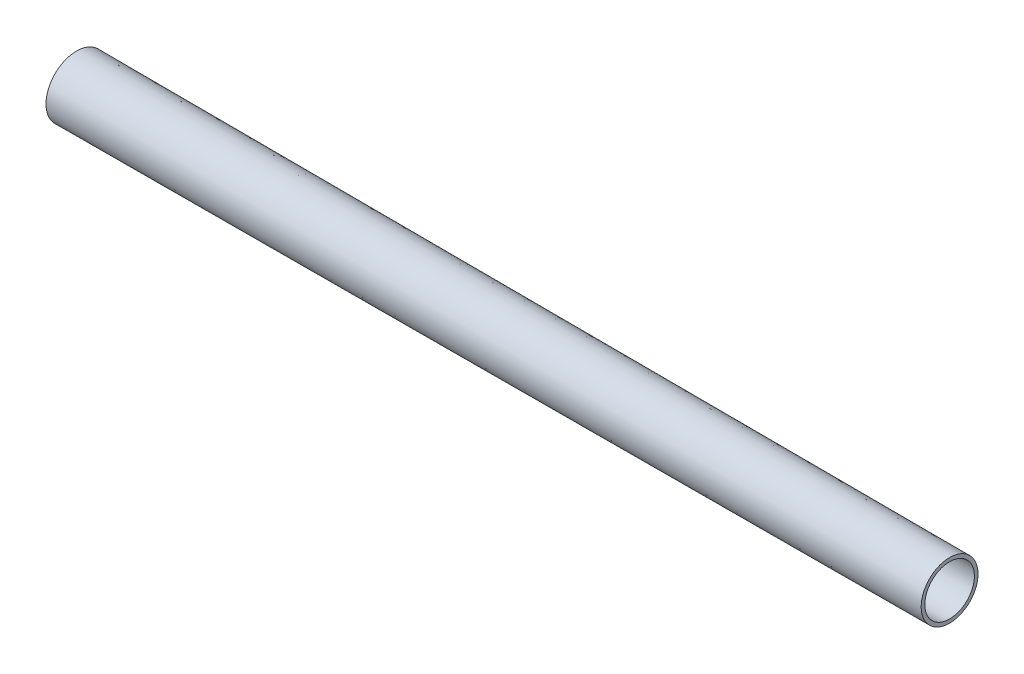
ISO-10303-21;
HEADER;
FILE_DESCRIPTION(('STEP AP214'),'2;1');
FILE_NAME('part.step','',(''),(''),'','','');
FILE_SCHEMA(('AUTOMOTIVE_DESIGN { 1 0 10303 214 1 1 1 1 }'));
ENDSEC;
DATA;
#1=APPLICATION_CONTEXT('core data for automotive mechanical design processes');
#2=APPLICATION_PROTOCOL_DEFINITION('international standard','automotive_design',2000,#1);
#3=PRODUCT_CONTEXT('',#1,'mechanical');
#4=PRODUCT('Part','Part','',(#3));
#5=PRODUCT_RELATED_PRODUCT_CATEGORY('part','',(#4));
#6=PRODUCT_DEFINITION_FORMATION('','',#4);
#7=PRODUCT_DEFINITION_CONTEXT('part definition',#1,'design');
#8=PRODUCT_DEFINITION('design','',#6,#7);
#9=PRODUCT_DEFINITION_SHAPE('','',#8);
#10=(LENGTH_UNIT() NAMED_UNIT(*) SI_UNIT(.MILLI.,.METRE.));
#11=(NAMED_UNIT(*) PLANE_ANGLE_UNIT() SI_UNIT($,.RADIAN.));
#12=(NAMED_UNIT(*) SI_UNIT($,.STERADIAN.) SOLID_ANGLE_UNIT());
#13=UNCERTAINTY_MEASURE_WITH_UNIT(LENGTH_MEASURE(1.E-05),#10,'distance_accuracy_value','');
#14=(GEOMETRIC_REPRESENTATION_CONTEXT(3) GLOBAL_UNCERTAINTY_ASSIGNED_CONTEXT((#13)) GLOBAL_UNIT_ASSIGNED_CONTEXT((#10,
#11,#12)) REPRESENTATION_CONTEXT('',''));
#15=CARTESIAN_POINT('',(0.,0.,0.));
#16=DIRECTION('',(0.,0.,1.));
#17=DIRECTION('',(1.,0.,0.));
#18=AXIS2_PLACEMENT_3D('',#15,#16,#17);
#19=CARTESIAN_POINT('',(34.29,0.,0.));
#20=DIRECTION('',(-1.,0.,0.));
#21=DIRECTION('',(0.,0.,1.));
#22=AXIS2_PLACEMENT_3D('',#19,#20,#21);
#23=CONICAL_SURFACE('',#22,7.43085106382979,0.00238894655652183);
#24=CARTESIAN_POINT('',(275.59,0.,0.));
#25=DIRECTION('',(-1.,0.,0.));
#26=DIRECTION('',(0.,0.,1.));
#27=AXIS2_PLACEMENT_3D('',#24,#25,#26);
#28=CIRCLE('',#27,6.85439716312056);
#29=CARTESIAN_POINT('',(275.59,0.,6.85439716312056));
#30=VERTEX_POINT('',#29);
#31=EDGE_CURVE('E10',#30,#30,#28,.T.);
#32=ORIENTED_EDGE('',*,*,#31,.F.);
#33=EDGE_LOOP('',(#32));
#34=FACE_BOUND('',#33,.T.);
#35=CARTESIAN_POINT('',(34.29,0.,0.));
#36=DIRECTION('',(-1.,0.,0.));
#37=DIRECTION('',(0.,0.,1.));
#38=AXIS2_PLACEMENT_3D('',#35,#36,#37);
#39=CIRCLE('',#38,7.43085106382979);
#40=CARTESIAN_POINT('',(34.29,0.,7.43085106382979));
#41=VERTEX_POINT('',#40);
#42=EDGE_CURVE('E47',#41,#41,#39,.T.);
#43=ORIENTED_EDGE('',*,*,#42,.T.);
#44=EDGE_LOOP('',(#43));
#45=FACE_BOUND('',#44,.T.);
#46=ADVANCED_FACE('F33',(#34,#45),#23,.F.);
#47=CARTESIAN_POINT('',(275.59,6.85439716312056,0.));
#48=DIRECTION('',(-1.,0.,0.));
#49=DIRECTION('',(0.,0.,1.));
#50=AXIS2_PLACEMENT_3D('',#47,#48,#49);
#51=PLANE('',#50);
#52=CARTESIAN_POINT('',(275.59,0.,0.));
#53=DIRECTION('',(-1.,0.,0.));
#54=DIRECTION('',(0.,0.,1.));
#55=AXIS2_PLACEMENT_3D('',#52,#53,#54);
#56=CIRCLE('',#55,7.8631914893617);
#57=CARTESIAN_POINT('',(275.59,0.,7.8631914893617));
#58=VERTEX_POINT('',#57);
#59=EDGE_CURVE('E39',#58,#58,#56,.T.);
#60=ORIENTED_EDGE('',*,*,#59,.F.);
#61=EDGE_LOOP('',(#60));
#62=FACE_BOUND('',#61,.T.);
#63=ORIENTED_EDGE('',*,*,#31,.T.);
#64=EDGE_LOOP('',(#63));
#65=FACE_BOUND('',#64,.T.);
#66=ADVANCED_FACE('F62',(#62,#65),#51,.F.);
#67=CARTESIAN_POINT('',(275.59,0.,0.));
#68=DIRECTION('',(-1.,0.,0.));
#69=DIRECTION('',(0.,0.,1.));
#70=AXIS2_PLACEMENT_3D('',#67,#68,#69);
#71=CONICAL_SURFACE('',#70,7.8631914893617,0.0023889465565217);
#72=CARTESIAN_POINT('',(34.29,0.,0.));
#73=DIRECTION('',(-1.,0.,0.));
#74=DIRECTION('',(0.,0.,1.));
#75=AXIS2_PLACEMENT_3D('',#72,#73,#74);
#76=CIRCLE('',#75,8.43964539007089);
#77=CARTESIAN_POINT('',(34.29,0.,8.43964539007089));
#78=VERTEX_POINT('',#77);
#79=EDGE_CURVE('E43',#78,#78,#76,.T.);
#80=ORIENTED_EDGE('',*,*,#79,.F.);
#81=EDGE_LOOP('',(#80));
#82=FACE_BOUND('',#81,.T.);
#83=ORIENTED_EDGE('',*,*,#59,.T.);
#84=EDGE_LOOP('',(#83));
#85=FACE_BOUND('',#84,.T.);
#86=ADVANCED_FACE('F57',(#82,#85),#71,.T.);
#87=CARTESIAN_POINT('',(34.29,8.43964539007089,0.));
#88=DIRECTION('',(1.,0.,0.));
#89=DIRECTION('',(0.,0.,-1.));
#90=AXIS2_PLACEMENT_3D('',#87,#88,#89);
#91=PLANE('',#90);
#92=ORIENTED_EDGE('',*,*,#42,.F.);
#93=EDGE_LOOP('',(#92));
#94=FACE_BOUND('',#93,.T.);
#95=ORIENTED_EDGE('',*,*,#79,.T.);
#96=EDGE_LOOP('',(#95));
#97=FACE_BOUND('',#96,.T.);
#98=ADVANCED_FACE('F54',(#94,#97),#91,.F.);
#99=CLOSED_SHELL('',(#46,#66,#86,#98));
#100=MANIFOLD_SOLID_BREP('B2',#99);
#101=ADVANCED_BREP_SHAPE_REPRESENTATION('',(#18,#100),#14);
#102=SHAPE_DEFINITION_REPRESENTATION(#9,#101);
ENDSEC;
END-ISO-10303-21;
